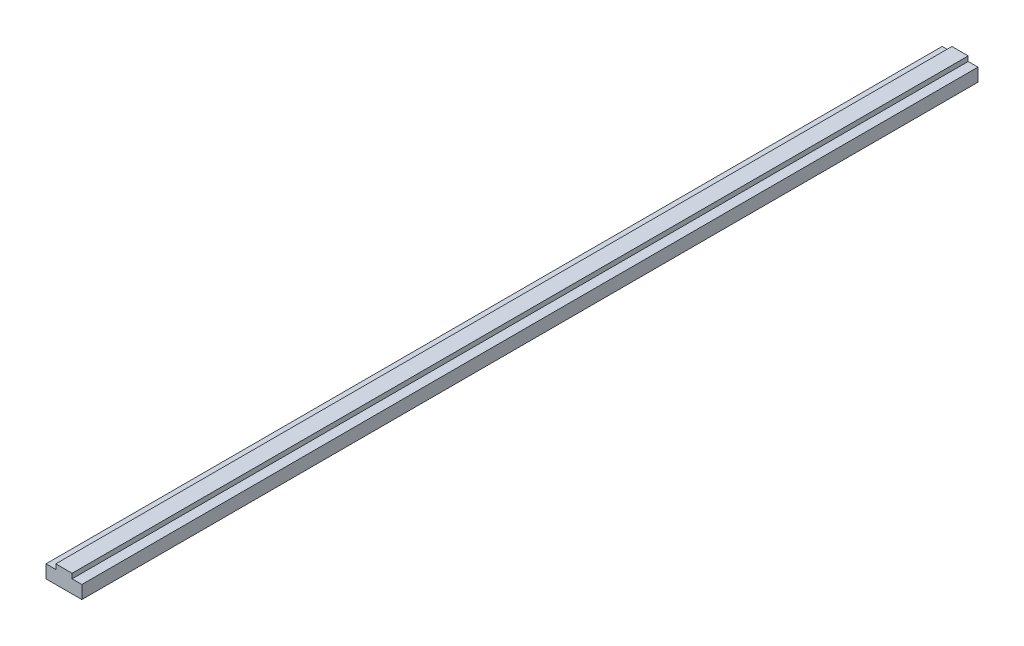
ISO-10303-21;
HEADER;
FILE_DESCRIPTION(('STEP AP214'),'2;1');
FILE_NAME('part.step','',(''),(''),'','','');
FILE_SCHEMA(('AUTOMOTIVE_DESIGN { 1 0 10303 214 1 1 1 1 }'));
ENDSEC;
DATA;
#1=APPLICATION_CONTEXT('core data for automotive mechanical design processes');
#2=APPLICATION_PROTOCOL_DEFINITION('international standard','automotive_design',2000,#1);
#3=PRODUCT_CONTEXT('',#1,'mechanical');
#4=PRODUCT('Part','Part','',(#3));
#5=PRODUCT_RELATED_PRODUCT_CATEGORY('part','',(#4));
#6=PRODUCT_DEFINITION_FORMATION('','',#4);
#7=PRODUCT_DEFINITION_CONTEXT('part definition',#1,'design');
#8=PRODUCT_DEFINITION('design','',#6,#7);
#9=PRODUCT_DEFINITION_SHAPE('','',#8);
#10=(LENGTH_UNIT() NAMED_UNIT(*) SI_UNIT(.MILLI.,.METRE.));
#11=(NAMED_UNIT(*) PLANE_ANGLE_UNIT() SI_UNIT($,.RADIAN.));
#12=(NAMED_UNIT(*) SI_UNIT($,.STERADIAN.) SOLID_ANGLE_UNIT());
#13=UNCERTAINTY_MEASURE_WITH_UNIT(LENGTH_MEASURE(1.E-05),#10,'distance_accuracy_value','');
#14=(GEOMETRIC_REPRESENTATION_CONTEXT(3) GLOBAL_UNCERTAINTY_ASSIGNED_CONTEXT((#13)) GLOBAL_UNIT_ASSIGNED_CONTEXT((#10,
#11,#12)) REPRESENTATION_CONTEXT('',''));
#15=CARTESIAN_POINT('',(0.,0.,0.));
#16=DIRECTION('',(0.,0.,1.));
#17=DIRECTION('',(1.,0.,0.));
#18=AXIS2_PLACEMENT_3D('',#15,#16,#17);
#19=CARTESIAN_POINT('',(4.54999999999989,10.,0.));
#20=DIRECTION('',(-1.,0.,0.));
#21=DIRECTION('',(0.,0.,1.));
#22=AXIS2_PLACEMENT_3D('',#19,#20,#21);
#23=PLANE('',#22);
#24=DIRECTION('',(0.,-1.,0.));
#25=VECTOR('',#24,1.);
#26=CARTESIAN_POINT('',(4.54999999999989,10.,500.));
#27=LINE('',#26,#25);
#28=CARTESIAN_POINT('',(4.54999999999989,10.,500.));
#29=VERTEX_POINT('',#28);
#30=CARTESIAN_POINT('',(4.54999999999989,7.30000000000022,500.));
#31=VERTEX_POINT('',#30);
#32=EDGE_CURVE('E110',#29,#31,#27,.T.);
#33=ORIENTED_EDGE('',*,*,#32,.T.);
#34=DIRECTION('',(0.,0.,1.));
#35=VECTOR('',#34,1.);
#36=CARTESIAN_POINT('',(4.54999999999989,7.30000000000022,0.));
#37=LINE('',#36,#35);
#38=CARTESIAN_POINT('',(4.54999999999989,7.30000000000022,0.));
#39=VERTEX_POINT('',#38);
#40=EDGE_CURVE('E9',#39,#31,#37,.T.);
#41=ORIENTED_EDGE('',*,*,#40,.F.);
#42=DIRECTION('',(0.,-1.,0.));
#43=VECTOR('',#42,1.);
#44=CARTESIAN_POINT('',(4.54999999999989,10.,0.));
#45=LINE('',#44,#43);
#46=CARTESIAN_POINT('',(4.54999999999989,10.,0.));
#47=VERTEX_POINT('',#46);
#48=EDGE_CURVE('E128',#47,#39,#45,.T.);
#49=ORIENTED_EDGE('',*,*,#48,.F.);
#50=DIRECTION('',(0.,0.,1.));
#51=VECTOR('',#50,1.);
#52=CARTESIAN_POINT('',(4.54999999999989,10.,0.));
#53=LINE('',#52,#51);
#54=EDGE_CURVE('E30',#47,#29,#53,.T.);
#55=ORIENTED_EDGE('',*,*,#54,.T.);
#56=EDGE_LOOP('',(#33,#41,#49,#55));
#57=FACE_BOUND('',#56,.T.);
#58=ADVANCED_FACE('F14',(#57),#23,.F.);
#59=CARTESIAN_POINT('',(4.54999999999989,7.30000000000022,0.));
#60=DIRECTION('',(0.,-1.,0.));
#61=DIRECTION('',(0.,0.,-1.));
#62=AXIS2_PLACEMENT_3D('',#59,#60,#61);
#63=PLANE('',#62);
#64=DIRECTION('',(1.,0.,0.));
#65=VECTOR('',#64,1.);
#66=CARTESIAN_POINT('',(4.54999999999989,7.30000000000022,500.));
#67=LINE('',#66,#65);
#68=CARTESIAN_POINT('',(10.,7.30000000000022,500.));
#69=VERTEX_POINT('',#68);
#70=EDGE_CURVE('E112',#31,#69,#67,.T.);
#71=ORIENTED_EDGE('',*,*,#70,.T.);
#72=DIRECTION('',(0.,0.,1.));
#73=VECTOR('',#72,1.);
#74=CARTESIAN_POINT('',(10.,7.30000000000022,0.));
#75=LINE('',#74,#73);
#76=CARTESIAN_POINT('',(10.,7.30000000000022,0.));
#77=VERTEX_POINT('',#76);
#78=EDGE_CURVE('E22',#77,#69,#75,.T.);
#79=ORIENTED_EDGE('',*,*,#78,.F.);
#80=DIRECTION('',(1.,0.,0.));
#81=VECTOR('',#80,1.);
#82=CARTESIAN_POINT('',(4.54999999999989,7.30000000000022,0.));
#83=LINE('',#82,#81);
#84=EDGE_CURVE('E68',#39,#77,#83,.T.);
#85=ORIENTED_EDGE('',*,*,#84,.F.);
#86=ORIENTED_EDGE('',*,*,#40,.T.);
#87=EDGE_LOOP('',(#71,#79,#85,#86));
#88=FACE_BOUND('',#87,.T.);
#89=ADVANCED_FACE('F157',(#88),#63,.F.);
#90=CARTESIAN_POINT('',(10.,7.30000000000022,0.));
#91=DIRECTION('',(-1.,0.,0.));
#92=DIRECTION('',(0.,-1.,0.));
#93=AXIS2_PLACEMENT_3D('',#90,#91,#92);
#94=PLANE('',#93);
#95=DIRECTION('',(0.,-1.,0.));
#96=VECTOR('',#95,1.);
#97=CARTESIAN_POINT('',(10.,7.30000000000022,500.));
#98=LINE('',#97,#96);
#99=CARTESIAN_POINT('',(10.,0.,500.));
#100=VERTEX_POINT('',#99);
#101=EDGE_CURVE('E114',#69,#100,#98,.T.);
#102=ORIENTED_EDGE('',*,*,#101,.T.);
#103=DIRECTION('',(0.,0.,1.));
#104=VECTOR('',#103,1.);
#105=CARTESIAN_POINT('',(10.,0.,0.));
#106=LINE('',#105,#104);
#107=CARTESIAN_POINT('',(10.,0.,0.));
#108=VERTEX_POINT('',#107);
#109=EDGE_CURVE('E134',#108,#100,#106,.T.);
#110=ORIENTED_EDGE('',*,*,#109,.F.);
#111=DIRECTION('',(0.,-1.,0.));
#112=VECTOR('',#111,1.);
#113=CARTESIAN_POINT('',(10.,7.30000000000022,0.));
#114=LINE('',#113,#112);
#115=EDGE_CURVE('E142',#77,#108,#114,.T.);
#116=ORIENTED_EDGE('',*,*,#115,.F.);
#117=ORIENTED_EDGE('',*,*,#78,.T.);
#118=EDGE_LOOP('',(#102,#110,#116,#117));
#119=FACE_BOUND('',#118,.T.);
#120=ADVANCED_FACE('F140',(#119),#94,.F.);
#121=CARTESIAN_POINT('',(10.,0.,0.));
#122=DIRECTION('',(0.,1.,0.));
#123=DIRECTION('',(0.,0.,1.));
#124=AXIS2_PLACEMENT_3D('',#121,#122,#123);
#125=PLANE('',#124);
#126=DIRECTION('',(-1.,0.,0.));
#127=VECTOR('',#126,1.);
#128=CARTESIAN_POINT('',(10.,0.,500.));
#129=LINE('',#128,#127);
#130=CARTESIAN_POINT('',(-10.,0.,500.));
#131=VERTEX_POINT('',#130);
#132=EDGE_CURVE('E116',#100,#131,#129,.T.);
#133=ORIENTED_EDGE('',*,*,#132,.T.);
#134=DIRECTION('',(0.,0.,1.));
#135=VECTOR('',#134,1.);
#136=CARTESIAN_POINT('',(-10.,0.,0.));
#137=LINE('',#136,#135);
#138=CARTESIAN_POINT('',(-10.,0.,0.));
#139=VERTEX_POINT('',#138);
#140=EDGE_CURVE('E132',#139,#131,#137,.T.);
#141=ORIENTED_EDGE('',*,*,#140,.F.);
#142=DIRECTION('',(-1.,0.,0.));
#143=VECTOR('',#142,1.);
#144=CARTESIAN_POINT('',(10.,0.,0.));
#145=LINE('',#144,#143);
#146=EDGE_CURVE('E151',#108,#139,#145,.T.);
#147=ORIENTED_EDGE('',*,*,#146,.F.);
#148=ORIENTED_EDGE('',*,*,#109,.T.);
#149=EDGE_LOOP('',(#133,#141,#147,#148));
#150=FACE_BOUND('',#149,.T.);
#151=ADVANCED_FACE('F149',(#150),#125,.F.);
#152=CARTESIAN_POINT('',(-10.,7.30000000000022,0.));
#153=DIRECTION('',(-1.,0.,0.));
#154=DIRECTION('',(0.,0.,1.));
#155=AXIS2_PLACEMENT_3D('',#152,#153,#154);
#156=PLANE('',#155);
#157=DIRECTION('',(0.,-1.,0.));
#158=VECTOR('',#157,1.);
#159=CARTESIAN_POINT('',(-10.,7.30000000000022,500.));
#160=LINE('',#159,#158);
#161=CARTESIAN_POINT('',(-10.,7.30000000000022,500.));
#162=VERTEX_POINT('',#161);
#163=EDGE_CURVE('E119',#162,#131,#160,.T.);
#164=ORIENTED_EDGE('',*,*,#163,.F.);
#165=DIRECTION('',(0.,0.,1.));
#166=VECTOR('',#165,1.);
#167=CARTESIAN_POINT('',(-10.,7.30000000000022,0.));
#168=LINE('',#167,#166);
#169=CARTESIAN_POINT('',(-10.,7.30000000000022,0.));
#170=VERTEX_POINT('',#169);
#171=EDGE_CURVE('E93',#170,#162,#168,.T.);
#172=ORIENTED_EDGE('',*,*,#171,.F.);
#173=DIRECTION('',(0.,-1.,0.));
#174=VECTOR('',#173,1.);
#175=CARTESIAN_POINT('',(-10.,7.30000000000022,0.));
#176=LINE('',#175,#174);
#177=EDGE_CURVE('E102',#170,#139,#176,.T.);
#178=ORIENTED_EDGE('',*,*,#177,.T.);
#179=ORIENTED_EDGE('',*,*,#140,.T.);
#180=EDGE_LOOP('',(#164,#172,#178,#179));
#181=FACE_BOUND('',#180,.T.);
#182=ADVANCED_FACE('F168',(#181),#156,.T.);
#183=CARTESIAN_POINT('',(-4.55,7.30000000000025,0.));
#184=DIRECTION('',(0.,1.,0.));
#185=DIRECTION('',(-1.,0.,0.));
#186=AXIS2_PLACEMENT_3D('',#183,#184,#185);
#187=PLANE('',#186);
#188=DIRECTION('',(-1.,0.,0.));
#189=VECTOR('',#188,1.);
#190=CARTESIAN_POINT('',(-4.55,7.30000000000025,500.));
#191=LINE('',#190,#189);
#192=CARTESIAN_POINT('',(-4.55,7.30000000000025,500.));
#193=VERTEX_POINT('',#192);
#194=EDGE_CURVE('E89',#193,#162,#191,.T.);
#195=ORIENTED_EDGE('',*,*,#194,.F.);
#196=DIRECTION('',(0.,0.,1.));
#197=VECTOR('',#196,1.);
#198=CARTESIAN_POINT('',(-4.55,7.30000000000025,0.));
#199=LINE('',#198,#197);
#200=CARTESIAN_POINT('',(-4.55,7.30000000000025,0.));
#201=VERTEX_POINT('',#200);
#202=EDGE_CURVE('E84',#201,#193,#199,.T.);
#203=ORIENTED_EDGE('',*,*,#202,.F.);
#204=DIRECTION('',(-1.,0.,0.));
#205=VECTOR('',#204,1.);
#206=CARTESIAN_POINT('',(-4.55,7.30000000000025,0.));
#207=LINE('',#206,#205);
#208=EDGE_CURVE('E87',#201,#170,#207,.T.);
#209=ORIENTED_EDGE('',*,*,#208,.T.);
#210=ORIENTED_EDGE('',*,*,#171,.T.);
#211=EDGE_LOOP('',(#195,#203,#209,#210));
#212=FACE_BOUND('',#211,.T.);
#213=ADVANCED_FACE('F86',(#212),#187,.T.);
#214=CARTESIAN_POINT('',(-4.55,10.,0.));
#215=DIRECTION('',(-1.,0.,0.));
#216=DIRECTION('',(0.,-1.,0.));
#217=AXIS2_PLACEMENT_3D('',#214,#215,#216);
#218=PLANE('',#217);
#219=DIRECTION('',(0.,-1.,0.));
#220=VECTOR('',#219,1.);
#221=CARTESIAN_POINT('',(-4.55,10.,500.));
#222=LINE('',#221,#220);
#223=CARTESIAN_POINT('',(-4.55,10.,500.));
#224=VERTEX_POINT('',#223);
#225=EDGE_CURVE('E123',#224,#193,#222,.T.);
#226=ORIENTED_EDGE('',*,*,#225,.F.);
#227=DIRECTION('',(0.,0.,1.));
#228=VECTOR('',#227,1.);
#229=CARTESIAN_POINT('',(-4.55,10.,0.));
#230=LINE('',#229,#228);
#231=CARTESIAN_POINT('',(-4.55,10.,0.));
#232=VERTEX_POINT('',#231);
#233=EDGE_CURVE('E56',#232,#224,#230,.T.);
#234=ORIENTED_EDGE('',*,*,#233,.F.);
#235=DIRECTION('',(0.,-1.,0.));
#236=VECTOR('',#235,1.);
#237=CARTESIAN_POINT('',(-4.55,10.,0.));
#238=LINE('',#237,#236);
#239=EDGE_CURVE('E100',#232,#201,#238,.T.);
#240=ORIENTED_EDGE('',*,*,#239,.T.);
#241=ORIENTED_EDGE('',*,*,#202,.T.);
#242=EDGE_LOOP('',(#226,#234,#240,#241));
#243=FACE_BOUND('',#242,.T.);
#244=ADVANCED_FACE('F104',(#243),#218,.T.);
#245=CARTESIAN_POINT('',(4.54999999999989,10.,0.));
#246=DIRECTION('',(0.,1.,0.));
#247=DIRECTION('',(-1.,0.,0.));
#248=AXIS2_PLACEMENT_3D('',#245,#246,#247);
#249=PLANE('',#248);
#250=DIRECTION('',(-1.,0.,0.));
#251=VECTOR('',#250,1.);
#252=CARTESIAN_POINT('',(4.54999999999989,10.,500.));
#253=LINE('',#252,#251);
#254=EDGE_CURVE('E125',#29,#224,#253,.T.);
#255=ORIENTED_EDGE('',*,*,#254,.F.);
#256=ORIENTED_EDGE('',*,*,#54,.F.);
#257=DIRECTION('',(-1.,0.,0.));
#258=VECTOR('',#257,1.);
#259=CARTESIAN_POINT('',(4.54999999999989,10.,0.));
#260=LINE('',#259,#258);
#261=EDGE_CURVE('E105',#47,#232,#260,.T.);
#262=ORIENTED_EDGE('',*,*,#261,.T.);
#263=ORIENTED_EDGE('',*,*,#233,.T.);
#264=EDGE_LOOP('',(#255,#256,#262,#263));
#265=FACE_BOUND('',#264,.T.);
#266=ADVANCED_FACE('F176',(#265),#249,.T.);
#267=CARTESIAN_POINT('',(4.54999999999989,7.30000000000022,0.));
#268=DIRECTION('',(0.,0.,1.));
#269=DIRECTION('',(1.,0.,0.));
#270=AXIS2_PLACEMENT_3D('',#267,#268,#269);
#271=PLANE('',#270);
#272=ORIENTED_EDGE('',*,*,#48,.T.);
#273=ORIENTED_EDGE('',*,*,#84,.T.);
#274=ORIENTED_EDGE('',*,*,#115,.T.);
#275=ORIENTED_EDGE('',*,*,#146,.T.);
#276=ORIENTED_EDGE('',*,*,#177,.F.);
#277=ORIENTED_EDGE('',*,*,#208,.F.);
#278=ORIENTED_EDGE('',*,*,#239,.F.);
#279=ORIENTED_EDGE('',*,*,#261,.F.);
#280=EDGE_LOOP('',(#272,#273,#274,#275,#276,#277,#278,#279));
#281=FACE_BOUND('',#280,.T.);
#282=ADVANCED_FACE('F98',(#281),#271,.F.);
#283=CARTESIAN_POINT('',(4.54999999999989,7.30000000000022,500.));
#284=DIRECTION('',(0.,0.,1.));
#285=DIRECTION('',(1.,0.,0.));
#286=AXIS2_PLACEMENT_3D('',#283,#284,#285);
#287=PLANE('',#286);
#288=ORIENTED_EDGE('',*,*,#32,.F.);
#289=ORIENTED_EDGE('',*,*,#254,.T.);
#290=ORIENTED_EDGE('',*,*,#225,.T.);
#291=ORIENTED_EDGE('',*,*,#194,.T.);
#292=ORIENTED_EDGE('',*,*,#163,.T.);
#293=ORIENTED_EDGE('',*,*,#132,.F.);
#294=ORIENTED_EDGE('',*,*,#101,.F.);
#295=ORIENTED_EDGE('',*,*,#70,.F.);
#296=EDGE_LOOP('',(#288,#289,#290,#291,#292,#293,#294,#295));
#297=FACE_BOUND('',#296,.T.);
#298=ADVANCED_FACE('F145',(#297),#287,.T.);
#299=CLOSED_SHELL('',(#58,#89,#120,#151,#182,#213,#244,#266,#282,#298));
#300=MANIFOLD_SOLID_BREP('B1',#299);
#301=ADVANCED_BREP_SHAPE_REPRESENTATION('',(#18,#300),#14);
#302=SHAPE_DEFINITION_REPRESENTATION(#9,#301);
ENDSEC;
END-ISO-10303-21;
